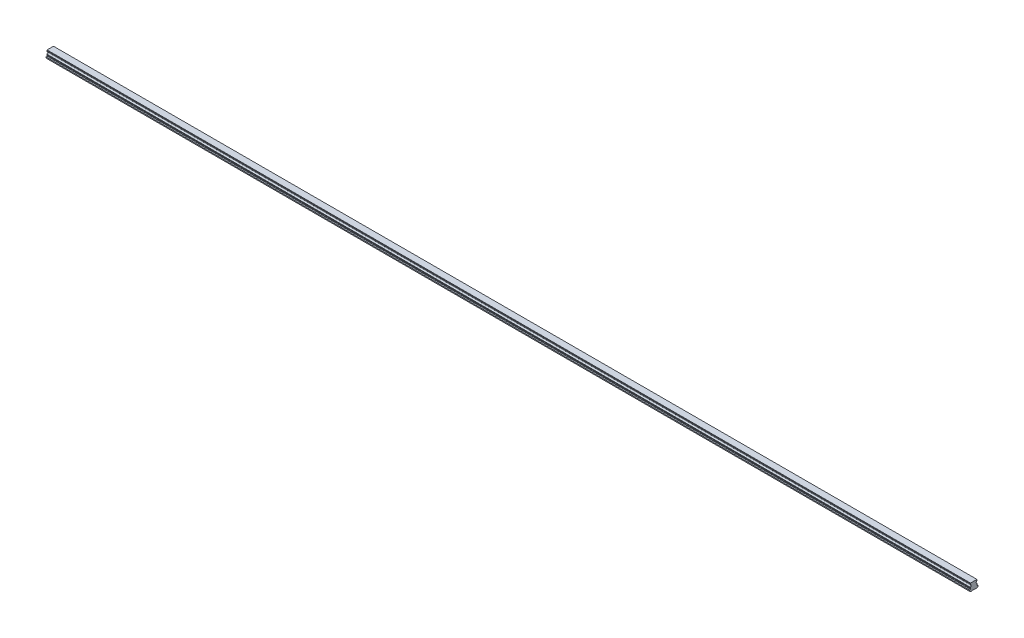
from build123d import *

# Parameters (mm, degrees)
BOSS_EXTRUDE1_DEPTH        = 2700
SKETCH3_R                  = 3
SKETCH3_R_2                = 2.5
CUT_EXTRUDE3_DEPTH         = 12
SKETCH3_2_R                = 2.5
CUT_EXTRUDE4_DEPTH         = 15
CHAMFER1_SIZE              = 0.5
LPATTERN4_COUNT            = 45
LPATTERN4_PITCH            = 60
CHAMFER1_OF_LPATTERN4_SIZE = 0.5


with BuildPart() as part:
    # Sketch1 → Boss-Extrude1 (new body)
    with BuildSketch(Plane(origin=(0, 0, 0), x_dir=(0, 0, -1), z_dir=(1, 0, 0))):
        with BuildLine():
            Line((9.375, 21.8), (-9.375, 21.8))
            Line((-9.375, 21.8), (-9.375, 20.756))
            Line((-9.375, 20.756), (-10, 19.415683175))
            Line((-10, 19.415683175), (-10, 17.685449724))
            ThreePointArc((-10, 17.685449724), (-7.2, 14.6), (-10, 11.514550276))
            Line((-10, 11.514550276), (-10, 9.784316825))
            Line((-10, 9.784316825), (-9.375, 8.444))
            Line((-9.375, 8.444), (-9.922688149, 6.4))
            Line((-9.922688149, 6.4), (-12.5, 5.489338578))
            Line((-12.5, 5.489338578), (-12.5, 2.65))
            Line((-12.5, 2.65), (-9.85, 0))
            Line((-9.85, 0), (-5.5, 0))
            Line((-5.5, 0), (-5, 0.5))
            Line((-5, 0.5), (5, 0.5))
            Line((5, 0.5), (5.5, 0))
            Line((5.5, 0), (9.85, 0))
            Line((9.85, 0), (12.5, 2.65))
            Line((12.5, 2.65), (12.5, 5.489338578))
            Line((12.5, 5.489338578), (9.922688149, 6.4))
            Line((9.922688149, 6.4), (9.375, 8.444))
            Line((9.375, 8.444), (10, 9.784316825))
            Line((10, 9.784316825), (10, 11.514550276))
            ThreePointArc((10, 11.514550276), (7.2, 14.6), (10, 17.685449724))
            Line((10, 17.685449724), (10, 19.415683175))
            Line((10, 19.415683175), (9.375, 20.756))
            Line((9.375, 20.756), (9.375, 21.8))
        make_face()
    extrude(amount=BOSS_EXTRUDE1_DEPTH)

    # Sketch3 → Cut-Extrude3 (cut)
    with BuildSketch(Plane.XZ):
        with Locations(Location((30, 0, 0), (0, 0, 270))):
            Circle(SKETCH3_R)
        with Locations(Location((30, 0, 0), (0, 0, 270))):
            Circle(SKETCH3_R_2, mode=Mode.SUBTRACT)
    cut_extrude3 = extrude(amount=-CUT_EXTRUDE3_DEPTH, mode=Mode.SUBTRACT)

    # Sketch3_2 → Cut-Extrude4 (cut)
    with BuildSketch(Plane.XZ):
        with Locations(Location((30, 0, 0), (0, 0, 270))):
            Circle(SKETCH3_2_R)
    cut_extrude4 = extrude(amount=-CUT_EXTRUDE4_DEPTH, mode=Mode.SUBTRACT)

    # Cut-Extrude5 cone 1 section (on through the dimple's axis) → Cut-Extrude5 (revolve, cut)
    with BuildSketch(Plane(origin=(30, 15, 0), x_dir=(0, 0, -1), z_dir=(1, 0, 0))):
        Polygon((0, 0), (2.5, 0), (0, 1.443375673), align=None)
    cut_extrude5 = revolve(axis=Axis((30, 15, 0), (0, 1, 0)), mode=Mode.SUBTRACT)

    # Chamfer1
    chamfer1_edges = [part.edges().sort_by_distance(p)[0] for p in [
        (30, 0.5, 3),
    ]]
    chamfer(chamfer1_edges, length=CHAMFER1_SIZE)

    # LPattern4: Cut-Extrude3, Cut-Extrude4, Cut-Extrude5 ×45
    with Locations(*[(i * LPATTERN4_PITCH, 0, 0) for i in range(1, LPATTERN4_COUNT)]):
        add(cut_extrude3, mode=Mode.SUBTRACT)
        add(cut_extrude4, mode=Mode.SUBTRACT)
        add(cut_extrude5, mode=Mode.SUBTRACT)

    # Chamfer1 of LPattern4
    chamfer1_of_lpattern4_edges = [part.edges().sort_by_distance(p)[0] for p in [
        (90, 0.5, 3),
        (150, 0.5, 3),
        (210, 0.5, 3),
        (270, 0.5, 3),
        (330, 0.5, 3),
        (390, 0.5, 3),
        (450, 0.5, 3),
        (510, 0.5, 3),
        (570, 0.5, 3),
        (630, 0.5, 3),
        (690, 0.5, 3),
        (750, 0.5, 3),
        (810, 0.5, 3),
        (870, 0.5, 3),
        (930, 0.5, 3),
        (990, 0.5, 3),
        (1050, 0.5, 3),
        (1110, 0.5, 3),
        (1170, 0.5, 3),
        (1230, 0.5, 3),
        (1290, 0.5, 3),
        (1350, 0.5, 3),
        (1410, 0.5, 3),
        (1470, 0.5, 3),
        (1530, 0.5, 3),
        (1590, 0.5, 3),
        (1650, 0.5, 3),
        (1710, 0.5, 3),
        (1770, 0.5, 3),
        (1830, 0.5, 3),
        (1890, 0.5, 3),
        (1950, 0.5, 3),
        (2010, 0.5, 3),
        (2070, 0.5, 3),
        (2130, 0.5, 3),
        (2190, 0.5, 3),
        (2250, 0.5, 3),
        (2310, 0.5, 3),
        (2370, 0.5, 3),
        (2430, 0.5, 3),
        (2490, 0.5, 3),
        (2550, 0.5, 3),
        (2610, 0.5, 3),
        (2670, 0.5, 3),
    ]]
    chamfer(chamfer1_of_lpattern4_edges, length=CHAMFER1_OF_LPATTERN4_SIZE)


solid = part.part
